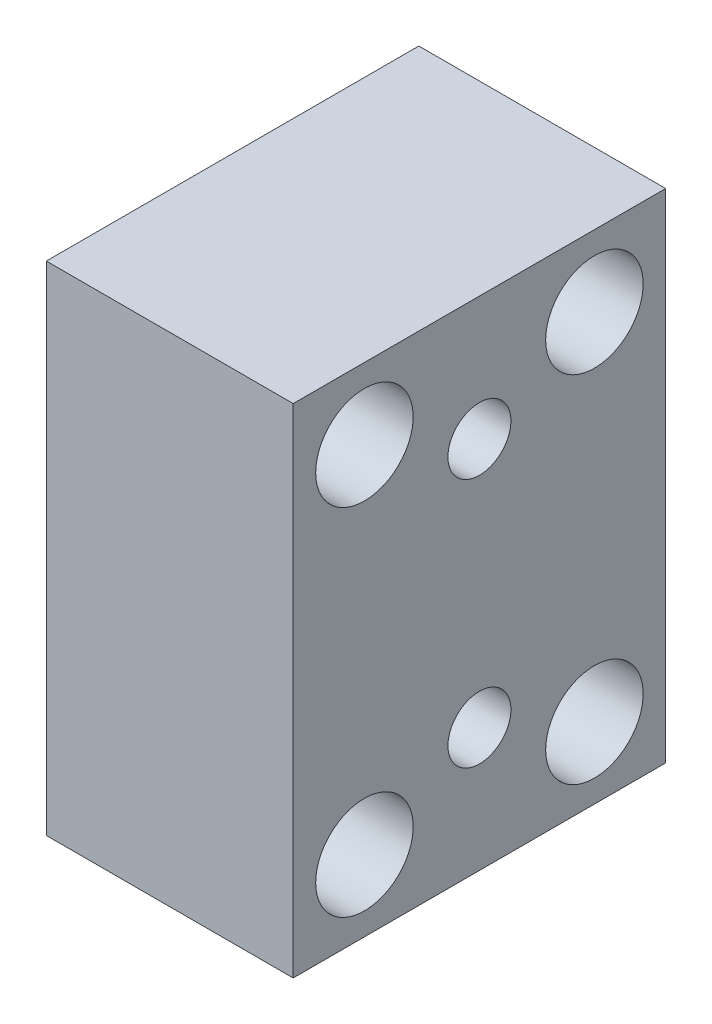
ISO-10303-21;
HEADER;
FILE_DESCRIPTION(('STEP AP214'),'2;1');
FILE_NAME('part.step','',(''),(''),'','','');
FILE_SCHEMA(('AUTOMOTIVE_DESIGN { 1 0 10303 214 1 1 1 1 }'));
ENDSEC;
DATA;
#1=APPLICATION_CONTEXT('core data for automotive mechanical design processes');
#2=APPLICATION_PROTOCOL_DEFINITION('international standard','automotive_design',2000,#1);
#3=PRODUCT_CONTEXT('',#1,'mechanical');
#4=PRODUCT('Part','Part','',(#3));
#5=PRODUCT_RELATED_PRODUCT_CATEGORY('part','',(#4));
#6=PRODUCT_DEFINITION_FORMATION('','',#4);
#7=PRODUCT_DEFINITION_CONTEXT('part definition',#1,'design');
#8=PRODUCT_DEFINITION('design','',#6,#7);
#9=PRODUCT_DEFINITION_SHAPE('','',#8);
#10=(LENGTH_UNIT() NAMED_UNIT(*) SI_UNIT(.MILLI.,.METRE.));
#11=(NAMED_UNIT(*) PLANE_ANGLE_UNIT() SI_UNIT($,.RADIAN.));
#12=(NAMED_UNIT(*) SI_UNIT($,.STERADIAN.) SOLID_ANGLE_UNIT());
#13=UNCERTAINTY_MEASURE_WITH_UNIT(LENGTH_MEASURE(1.E-05),#10,'distance_accuracy_value','');
#14=(GEOMETRIC_REPRESENTATION_CONTEXT(3) GLOBAL_UNCERTAINTY_ASSIGNED_CONTEXT((#13)) GLOBAL_UNIT_ASSIGNED_CONTEXT((#10,
#11,#12)) REPRESENTATION_CONTEXT('',''));
#15=CARTESIAN_POINT('',(0.,0.,0.));
#16=DIRECTION('',(0.,0.,1.));
#17=DIRECTION('',(1.,0.,0.));
#18=AXIS2_PLACEMENT_3D('',#15,#16,#17);
#19=CARTESIAN_POINT('',(12.54125,-25.273,18.923));
#20=DIRECTION('',(-1.,0.,0.));
#21=DIRECTION('',(0.,0.,1.));
#22=AXIS2_PLACEMENT_3D('',#19,#20,#21);
#23=PLANE('',#22);
#24=CARTESIAN_POINT('',(12.54125,-12.7,0.));
#25=DIRECTION('',(-1.,0.,0.));
#26=DIRECTION('',(0.,0.,1.));
#27=AXIS2_PLACEMENT_3D('',#24,#25,#26);
#28=CIRCLE('',#27,3.2004);
#29=CARTESIAN_POINT('',(12.54125,-12.7,3.2004));
#30=VERTEX_POINT('',#29);
#31=EDGE_CURVE('E224',#30,#30,#28,.F.);
#32=ORIENTED_EDGE('',*,*,#31,.F.);
#33=EDGE_LOOP('',(#32));
#34=FACE_BOUND('',#33,.T.);
#35=CARTESIAN_POINT('',(12.54125,-18.034,-11.684));
#36=DIRECTION('',(-1.,0.,0.));
#37=DIRECTION('',(0.,0.,1.));
#38=AXIS2_PLACEMENT_3D('',#35,#36,#37);
#39=CIRCLE('',#38,4.953);
#40=CARTESIAN_POINT('',(12.54125,-18.034,-6.731));
#41=VERTEX_POINT('',#40);
#42=EDGE_CURVE('E232',#41,#41,#39,.F.);
#43=ORIENTED_EDGE('',*,*,#42,.F.);
#44=EDGE_LOOP('',(#43));
#45=FACE_BOUND('',#44,.T.);
#46=CARTESIAN_POINT('',(12.54125,18.034,-11.684));
#47=DIRECTION('',(-1.,0.,0.));
#48=DIRECTION('',(0.,0.,1.));
#49=AXIS2_PLACEMENT_3D('',#46,#47,#48);
#50=CIRCLE('',#49,4.953);
#51=CARTESIAN_POINT('',(12.54125,18.034,-6.731));
#52=VERTEX_POINT('',#51);
#53=EDGE_CURVE('E338',#52,#52,#50,.F.);
#54=ORIENTED_EDGE('',*,*,#53,.F.);
#55=EDGE_LOOP('',(#54));
#56=FACE_BOUND('',#55,.T.);
#57=DIRECTION('',(0.,1.,0.));
#58=VECTOR('',#57,1.);
#59=CARTESIAN_POINT('',(12.54125,-25.273,-18.923));
#60=LINE('',#59,#58);
#61=CARTESIAN_POINT('',(12.54125,-25.273,-18.923));
#62=VERTEX_POINT('',#61);
#63=CARTESIAN_POINT('',(12.54125,25.273,-18.923));
#64=VERTEX_POINT('',#63);
#65=EDGE_CURVE('E359',#62,#64,#60,.T.);
#66=ORIENTED_EDGE('',*,*,#65,.T.);
#67=DIRECTION('',(0.,0.,-1.));
#68=VECTOR('',#67,1.);
#69=CARTESIAN_POINT('',(12.54125,25.273,18.923));
#70=LINE('',#69,#68);
#71=CARTESIAN_POINT('',(12.54125,25.273,18.923));
#72=VERTEX_POINT('',#71);
#73=EDGE_CURVE('E364',#72,#64,#70,.T.);
#74=ORIENTED_EDGE('',*,*,#73,.F.);
#75=DIRECTION('',(0.,1.,0.));
#76=VECTOR('',#75,1.);
#77=CARTESIAN_POINT('',(12.54125,-25.273,18.923));
#78=LINE('',#77,#76);
#79=CARTESIAN_POINT('',(12.54125,-25.273,18.923));
#80=VERTEX_POINT('',#79);
#81=EDGE_CURVE('E350',#80,#72,#78,.T.);
#82=ORIENTED_EDGE('',*,*,#81,.F.);
#83=DIRECTION('',(0.,0.,-1.));
#84=VECTOR('',#83,1.);
#85=CARTESIAN_POINT('',(12.54125,-25.273,18.923));
#86=LINE('',#85,#84);
#87=EDGE_CURVE('E367',#80,#62,#86,.T.);
#88=ORIENTED_EDGE('',*,*,#87,.T.);
#89=EDGE_LOOP('',(#66,#74,#82,#88));
#90=FACE_BOUND('',#89,.T.);
#91=CARTESIAN_POINT('',(12.54125,-18.034,11.684));
#92=DIRECTION('',(-1.,0.,0.));
#93=DIRECTION('',(0.,0.,1.));
#94=AXIS2_PLACEMENT_3D('',#91,#92,#93);
#95=CIRCLE('',#94,4.953);
#96=CARTESIAN_POINT('',(12.54125,-18.034,16.637));
#97=VERTEX_POINT('',#96);
#98=EDGE_CURVE('E339',#97,#97,#95,.F.);
#99=ORIENTED_EDGE('',*,*,#98,.F.);
#100=EDGE_LOOP('',(#99));
#101=FACE_BOUND('',#100,.T.);
#102=CARTESIAN_POINT('',(12.54125,18.034,11.684));
#103=DIRECTION('',(-1.,0.,0.));
#104=DIRECTION('',(0.,0.,1.));
#105=AXIS2_PLACEMENT_3D('',#102,#103,#104);
#106=CIRCLE('',#105,4.953);
#107=CARTESIAN_POINT('',(12.54125,18.034,16.637));
#108=VERTEX_POINT('',#107);
#109=EDGE_CURVE('E228',#108,#108,#106,.F.);
#110=ORIENTED_EDGE('',*,*,#109,.F.);
#111=EDGE_LOOP('',(#110));
#112=FACE_BOUND('',#111,.T.);
#113=CARTESIAN_POINT('',(12.54125,12.7,0.));
#114=DIRECTION('',(-1.,0.,0.));
#115=DIRECTION('',(0.,0.,1.));
#116=AXIS2_PLACEMENT_3D('',#113,#114,#115);
#117=CIRCLE('',#116,3.2004);
#118=CARTESIAN_POINT('',(12.54125,12.7,3.2004));
#119=VERTEX_POINT('',#118);
#120=EDGE_CURVE('E42',#119,#119,#117,.F.);
#121=ORIENTED_EDGE('',*,*,#120,.F.);
#122=EDGE_LOOP('',(#121));
#123=FACE_BOUND('',#122,.T.);
#124=ADVANCED_FACE('F38',(#34,#45,#56,#90,#101,#112,#123),#23,.F.);
#125=CARTESIAN_POINT('',(-12.573,18.034,11.684));
#126=DIRECTION('',(1.,0.,0.));
#127=DIRECTION('',(0.,0.,-1.));
#128=AXIS2_PLACEMENT_3D('',#125,#126,#127);
#129=PLANE('',#128);
#130=CARTESIAN_POINT('',(-12.573,18.034,11.684));
#131=DIRECTION('',(-1.,0.,0.));
#132=DIRECTION('',(0.,0.,1.));
#133=AXIS2_PLACEMENT_3D('',#130,#131,#132);
#134=CIRCLE('',#133,2.73558);
#135=CARTESIAN_POINT('',(-12.573,18.034,14.41958));
#136=VERTEX_POINT('',#135);
#137=EDGE_CURVE('E277',#136,#136,#134,.T.);
#138=ORIENTED_EDGE('',*,*,#137,.T.);
#139=EDGE_LOOP('',(#138));
#140=FACE_BOUND('',#139,.T.);
#141=DIRECTION('',(0.,-0.500000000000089,0.866025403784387));
#142=VECTOR('',#141,1.);
#143=CARTESIAN_POINT('',(-12.573,19.500469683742,11.684));
#144=LINE('',#143,#142);
#145=CARTESIAN_POINT('',(-12.573,19.500469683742,11.684));
#146=VERTEX_POINT('',#145);
#147=CARTESIAN_POINT('',(-12.573,18.767234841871,12.954));
#148=VERTEX_POINT('',#147);
#149=EDGE_CURVE('E55',#146,#148,#144,.T.);
#150=ORIENTED_EDGE('',*,*,#149,.T.);
#151=DIRECTION('',(0.,-1.,0.));
#152=VECTOR('',#151,1.);
#153=CARTESIAN_POINT('',(-12.573,18.767234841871,12.954));
#154=LINE('',#153,#152);
#155=CARTESIAN_POINT('',(-12.573,17.300765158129,12.954));
#156=VERTEX_POINT('',#155);
#157=EDGE_CURVE('E249',#148,#156,#154,.T.);
#158=ORIENTED_EDGE('',*,*,#157,.T.);
#159=DIRECTION('',(0.,-0.500000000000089,-0.866025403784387));
#160=VECTOR('',#159,1.);
#161=CARTESIAN_POINT('',(-12.573,17.300765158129,12.954));
#162=LINE('',#161,#160);
#163=CARTESIAN_POINT('',(-12.573,16.567530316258,11.684));
#164=VERTEX_POINT('',#163);
#165=EDGE_CURVE('E252',#156,#164,#162,.T.);
#166=ORIENTED_EDGE('',*,*,#165,.T.);
#167=DIRECTION('',(0.,0.500000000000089,-0.866025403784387));
#168=VECTOR('',#167,1.);
#169=CARTESIAN_POINT('',(-12.573,16.567530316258,11.684));
#170=LINE('',#169,#168);
#171=CARTESIAN_POINT('',(-12.573,17.300765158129,10.414));
#172=VERTEX_POINT('',#171);
#173=EDGE_CURVE('E255',#164,#172,#170,.T.);
#174=ORIENTED_EDGE('',*,*,#173,.T.);
#175=DIRECTION('',(0.,1.,0.));
#176=VECTOR('',#175,1.);
#177=CARTESIAN_POINT('',(-12.573,17.300765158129,10.414));
#178=LINE('',#177,#176);
#179=CARTESIAN_POINT('',(-12.573,18.767234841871,10.414));
#180=VERTEX_POINT('',#179);
#181=EDGE_CURVE('E258',#172,#180,#178,.T.);
#182=ORIENTED_EDGE('',*,*,#181,.T.);
#183=DIRECTION('',(0.,0.500000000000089,0.866025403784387));
#184=VECTOR('',#183,1.);
#185=CARTESIAN_POINT('',(-12.573,18.767234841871,10.414));
#186=LINE('',#185,#184);
#187=EDGE_CURVE('E237',#180,#146,#186,.T.);
#188=ORIENTED_EDGE('',*,*,#187,.T.);
#189=EDGE_LOOP('',(#150,#158,#166,#174,#182,#188));
#190=FACE_BOUND('',#189,.T.);
#191=ADVANCED_FACE('F393',(#140,#190),#129,.F.);
#192=CARTESIAN_POINT('',(0.,18.034,11.684));
#193=DIRECTION('',(1.,0.,0.));
#194=DIRECTION('',(0.,0.,-1.));
#195=AXIS2_PLACEMENT_3D('',#192,#193,#194);
#196=PLANE('',#195);
#197=CARTESIAN_POINT('',(0.,18.034,11.684));
#198=DIRECTION('',(1.,0.,0.));
#199=DIRECTION('',(0.,0.,-1.));
#200=AXIS2_PLACEMENT_3D('',#197,#198,#199);
#201=CIRCLE('',#200,4.5593);
#202=CARTESIAN_POINT('',(0.,18.034,7.1247));
#203=VERTEX_POINT('',#202);
#204=EDGE_CURVE('E331',#203,#203,#201,.T.);
#205=ORIENTED_EDGE('',*,*,#204,.F.);
#206=EDGE_LOOP('',(#205));
#207=FACE_BOUND('',#206,.T.);
#208=CARTESIAN_POINT('',(0.,18.034,11.684));
#209=DIRECTION('',(1.,0.,0.));
#210=DIRECTION('',(0.,0.,-1.));
#211=AXIS2_PLACEMENT_3D('',#208,#209,#210);
#212=CIRCLE('',#211,3.64744);
#213=CARTESIAN_POINT('',(0.,18.034,8.03656));
#214=VERTEX_POINT('',#213);
#215=EDGE_CURVE('E11',#214,#214,#212,.F.);
#216=ORIENTED_EDGE('',*,*,#215,.F.);
#217=EDGE_LOOP('',(#216));
#218=FACE_BOUND('',#217,.T.);
#219=ADVANCED_FACE('F484',(#207,#218),#196,.F.);
#220=CARTESIAN_POINT('',(-12.573,-18.034,-11.684));
#221=DIRECTION('',(1.,0.,0.));
#222=DIRECTION('',(0.,0.,-1.));
#223=AXIS2_PLACEMENT_3D('',#220,#221,#222);
#224=PLANE('',#223);
#225=CARTESIAN_POINT('',(-12.573,-18.034,-11.684));
#226=DIRECTION('',(-1.,0.,0.));
#227=DIRECTION('',(0.,0.,1.));
#228=AXIS2_PLACEMENT_3D('',#225,#226,#227);
#229=CIRCLE('',#228,2.73558);
#230=CARTESIAN_POINT('',(-12.573,-18.034,-8.94842));
#231=VERTEX_POINT('',#230);
#232=EDGE_CURVE('E324',#231,#231,#229,.T.);
#233=ORIENTED_EDGE('',*,*,#232,.T.);
#234=EDGE_LOOP('',(#233));
#235=FACE_BOUND('',#234,.T.);
#236=DIRECTION('',(0.,-0.500000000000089,0.866025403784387));
#237=VECTOR('',#236,1.);
#238=CARTESIAN_POINT('',(-12.573,-16.567530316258,-11.684));
#239=LINE('',#238,#237);
#240=CARTESIAN_POINT('',(-12.573,-16.567530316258,-11.684));
#241=VERTEX_POINT('',#240);
#242=CARTESIAN_POINT('',(-12.573,-17.300765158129,-10.414));
#243=VERTEX_POINT('',#242);
#244=EDGE_CURVE('E63',#241,#243,#239,.T.);
#245=ORIENTED_EDGE('',*,*,#244,.T.);
#246=DIRECTION('',(0.,-1.,0.));
#247=VECTOR('',#246,1.);
#248=CARTESIAN_POINT('',(-12.573,-17.300765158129,-10.414));
#249=LINE('',#248,#247);
#250=CARTESIAN_POINT('',(-12.573,-18.767234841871,-10.414));
#251=VERTEX_POINT('',#250);
#252=EDGE_CURVE('E296',#243,#251,#249,.T.);
#253=ORIENTED_EDGE('',*,*,#252,.T.);
#254=DIRECTION('',(0.,-0.500000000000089,-0.866025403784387));
#255=VECTOR('',#254,1.);
#256=CARTESIAN_POINT('',(-12.573,-18.767234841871,-10.414));
#257=LINE('',#256,#255);
#258=CARTESIAN_POINT('',(-12.573,-19.500469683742,-11.684));
#259=VERTEX_POINT('',#258);
#260=EDGE_CURVE('E299',#251,#259,#257,.T.);
#261=ORIENTED_EDGE('',*,*,#260,.T.);
#262=DIRECTION('',(0.,0.500000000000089,-0.866025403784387));
#263=VECTOR('',#262,1.);
#264=CARTESIAN_POINT('',(-12.573,-19.500469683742,-11.684));
#265=LINE('',#264,#263);
#266=CARTESIAN_POINT('',(-12.573,-18.767234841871,-12.954));
#267=VERTEX_POINT('',#266);
#268=EDGE_CURVE('E302',#259,#267,#265,.T.);
#269=ORIENTED_EDGE('',*,*,#268,.T.);
#270=DIRECTION('',(0.,1.,0.));
#271=VECTOR('',#270,1.);
#272=CARTESIAN_POINT('',(-12.573,-18.767234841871,-12.954));
#273=LINE('',#272,#271);
#274=CARTESIAN_POINT('',(-12.573,-17.300765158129,-12.954));
#275=VERTEX_POINT('',#274);
#276=EDGE_CURVE('E305',#267,#275,#273,.T.);
#277=ORIENTED_EDGE('',*,*,#276,.T.);
#278=DIRECTION('',(0.,0.500000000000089,0.866025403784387));
#279=VECTOR('',#278,1.);
#280=CARTESIAN_POINT('',(-12.573,-17.300765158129,-12.954));
#281=LINE('',#280,#279);
#282=EDGE_CURVE('E284',#275,#241,#281,.T.);
#283=ORIENTED_EDGE('',*,*,#282,.T.);
#284=EDGE_LOOP('',(#245,#253,#261,#269,#277,#283));
#285=FACE_BOUND('',#284,.T.);
#286=ADVANCED_FACE('F521',(#235,#285),#224,.F.);
#287=CARTESIAN_POINT('',(0.,-18.034,-11.684));
#288=DIRECTION('',(1.,0.,0.));
#289=DIRECTION('',(0.,0.,-1.));
#290=AXIS2_PLACEMENT_3D('',#287,#288,#289);
#291=PLANE('',#290);
#292=CARTESIAN_POINT('',(0.,-18.034,-11.684));
#293=DIRECTION('',(1.,0.,0.));
#294=DIRECTION('',(0.,0.,-1.));
#295=AXIS2_PLACEMENT_3D('',#292,#293,#294);
#296=CIRCLE('',#295,4.5593);
#297=CARTESIAN_POINT('',(0.,-18.034,-16.2433));
#298=VERTEX_POINT('',#297);
#299=EDGE_CURVE('E327',#298,#298,#296,.T.);
#300=ORIENTED_EDGE('',*,*,#299,.F.);
#301=EDGE_LOOP('',(#300));
#302=FACE_BOUND('',#301,.T.);
#303=CARTESIAN_POINT('',(0.,-18.034,-11.684));
#304=DIRECTION('',(1.,0.,0.));
#305=DIRECTION('',(0.,0.,-1.));
#306=AXIS2_PLACEMENT_3D('',#303,#304,#305);
#307=CIRCLE('',#306,3.64744);
#308=CARTESIAN_POINT('',(0.,-18.034,-15.33144));
#309=VERTEX_POINT('',#308);
#310=EDGE_CURVE('E47',#309,#309,#307,.F.);
#311=ORIENTED_EDGE('',*,*,#310,.F.);
#312=EDGE_LOOP('',(#311));
#313=FACE_BOUND('',#312,.T.);
#314=ADVANCED_FACE('F524',(#302,#313),#291,.F.);
#315=CARTESIAN_POINT('',(-12.54125,25.273,18.923));
#316=DIRECTION('',(1.,0.,0.));
#317=DIRECTION('',(0.,1.,0.));
#318=AXIS2_PLACEMENT_3D('',#315,#316,#317);
#319=PLANE('',#318);
#320=CARTESIAN_POINT('',(-12.54125,12.7,0.));
#321=DIRECTION('',(-1.,0.,0.));
#322=DIRECTION('',(0.,0.,1.));
#323=AXIS2_PLACEMENT_3D('',#320,#321,#322);
#324=CIRCLE('',#323,2.38125);
#325=CARTESIAN_POINT('',(-12.54125,12.7,2.38125));
#326=VERTEX_POINT('',#325);
#327=EDGE_CURVE('E184',#326,#326,#324,.T.);
#328=ORIENTED_EDGE('',*,*,#327,.F.);
#329=EDGE_LOOP('',(#328));
#330=FACE_BOUND('',#329,.T.);
#331=CARTESIAN_POINT('',(-12.54125,-12.7,0.));
#332=DIRECTION('',(-1.,0.,0.));
#333=DIRECTION('',(0.,0.,1.));
#334=AXIS2_PLACEMENT_3D('',#331,#332,#333);
#335=CIRCLE('',#334,2.38125);
#336=CARTESIAN_POINT('',(-12.54125,-12.7,2.38125));
#337=VERTEX_POINT('',#336);
#338=EDGE_CURVE('E183',#337,#337,#335,.T.);
#339=ORIENTED_EDGE('',*,*,#338,.F.);
#340=EDGE_LOOP('',(#339));
#341=FACE_BOUND('',#340,.T.);
#342=CARTESIAN_POINT('',(-12.54125,20.6375,0.));
#343=DIRECTION('',(-1.,0.,0.));
#344=DIRECTION('',(0.,0.,1.));
#345=AXIS2_PLACEMENT_3D('',#342,#343,#344);
#346=CIRCLE('',#345,2.01929999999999);
#347=CARTESIAN_POINT('',(-12.54125,20.6375,2.01929999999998));
#348=VERTEX_POINT('',#347);
#349=EDGE_CURVE('E194',#348,#348,#346,.T.);
#350=ORIENTED_EDGE('',*,*,#349,.F.);
#351=EDGE_LOOP('',(#350));
#352=FACE_BOUND('',#351,.T.);
#353=CARTESIAN_POINT('',(-12.54125,0.,-11.1125));
#354=DIRECTION('',(-1.,0.,0.));
#355=DIRECTION('',(0.,0.,1.));
#356=AXIS2_PLACEMENT_3D('',#353,#354,#355);
#357=CIRCLE('',#356,2.01929999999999);
#358=CARTESIAN_POINT('',(-12.54125,0.,-9.09320000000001));
#359=VERTEX_POINT('',#358);
#360=EDGE_CURVE('E200',#359,#359,#357,.T.);
#361=ORIENTED_EDGE('',*,*,#360,.F.);
#362=EDGE_LOOP('',(#361));
#363=FACE_BOUND('',#362,.T.);
#364=CARTESIAN_POINT('',(-12.54125,0.,11.1125));
#365=DIRECTION('',(-1.,0.,0.));
#366=DIRECTION('',(0.,0.,1.));
#367=AXIS2_PLACEMENT_3D('',#364,#365,#366);
#368=CIRCLE('',#367,2.01929999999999);
#369=CARTESIAN_POINT('',(-12.54125,0.,13.1318));
#370=VERTEX_POINT('',#369);
#371=EDGE_CURVE('E206',#370,#370,#368,.T.);
#372=ORIENTED_EDGE('',*,*,#371,.F.);
#373=EDGE_LOOP('',(#372));
#374=FACE_BOUND('',#373,.T.);
#375=CARTESIAN_POINT('',(-12.54125,-20.6375,0.));
#376=DIRECTION('',(-1.,0.,0.));
#377=DIRECTION('',(0.,0.,1.));
#378=AXIS2_PLACEMENT_3D('',#375,#376,#377);
#379=CIRCLE('',#378,2.01929999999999);
#380=CARTESIAN_POINT('',(-12.54125,-20.6375,2.01929999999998));
#381=VERTEX_POINT('',#380);
#382=EDGE_CURVE('E212',#381,#381,#379,.T.);
#383=ORIENTED_EDGE('',*,*,#382,.F.);
#384=EDGE_LOOP('',(#383));
#385=FACE_BOUND('',#384,.T.);
#386=CARTESIAN_POINT('',(-12.54125,18.034,11.684));
#387=DIRECTION('',(1.,0.,0.));
#388=DIRECTION('',(0.,1.,0.));
#389=AXIS2_PLACEMENT_3D('',#386,#387,#388);
#390=CIRCLE('',#389,4.5593);
#391=CARTESIAN_POINT('',(-12.54125,22.5933,11.684));
#392=VERTEX_POINT('',#391);
#393=EDGE_CURVE('E334',#392,#392,#390,.F.);
#394=ORIENTED_EDGE('',*,*,#393,.F.);
#395=EDGE_LOOP('',(#394));
#396=FACE_BOUND('',#395,.T.);
#397=CARTESIAN_POINT('',(-12.54125,18.034,-11.684));
#398=DIRECTION('',(1.,0.,0.));
#399=DIRECTION('',(0.,1.,0.));
#400=AXIS2_PLACEMENT_3D('',#397,#398,#399);
#401=CIRCLE('',#400,4.953);
#402=CARTESIAN_POINT('',(-12.54125,22.987,-11.684));
#403=VERTEX_POINT('',#402);
#404=EDGE_CURVE('E340',#403,#403,#401,.F.);
#405=ORIENTED_EDGE('',*,*,#404,.F.);
#406=EDGE_LOOP('',(#405));
#407=FACE_BOUND('',#406,.T.);
#408=DIRECTION('',(0.,-1.,0.));
#409=VECTOR('',#408,1.);
#410=CARTESIAN_POINT('',(-12.54125,25.273,-18.923));
#411=LINE('',#410,#409);
#412=CARTESIAN_POINT('',(-12.54125,25.273,-18.923));
#413=VERTEX_POINT('',#412);
#414=CARTESIAN_POINT('',(-12.54125,-25.273,-18.923));
#415=VERTEX_POINT('',#414);
#416=EDGE_CURVE('E343',#413,#415,#411,.T.);
#417=ORIENTED_EDGE('',*,*,#416,.T.);
#418=DIRECTION('',(0.,0.,-1.));
#419=VECTOR('',#418,1.);
#420=CARTESIAN_POINT('',(-12.54125,-25.273,18.923));
#421=LINE('',#420,#419);
#422=CARTESIAN_POINT('',(-12.54125,-25.273,18.923));
#423=VERTEX_POINT('',#422);
#424=EDGE_CURVE('E370',#423,#415,#421,.T.);
#425=ORIENTED_EDGE('',*,*,#424,.F.);
#426=DIRECTION('',(0.,-1.,0.));
#427=VECTOR('',#426,1.);
#428=CARTESIAN_POINT('',(-12.54125,25.273,18.923));
#429=LINE('',#428,#427);
#430=CARTESIAN_POINT('',(-12.54125,25.273,18.923));
#431=VERTEX_POINT('',#430);
#432=EDGE_CURVE('E344',#431,#423,#429,.T.);
#433=ORIENTED_EDGE('',*,*,#432,.F.);
#434=DIRECTION('',(0.,0.,-1.));
#435=VECTOR('',#434,1.);
#436=CARTESIAN_POINT('',(-12.54125,25.273,18.923));
#437=LINE('',#436,#435);
#438=EDGE_CURVE('E354',#431,#413,#437,.T.);
#439=ORIENTED_EDGE('',*,*,#438,.T.);
#440=EDGE_LOOP('',(#417,#425,#433,#439));
#441=FACE_BOUND('',#440,.T.);
#442=CARTESIAN_POINT('',(-12.54125,-18.034,11.684));
#443=DIRECTION('',(1.,0.,0.));
#444=DIRECTION('',(0.,1.,0.));
#445=AXIS2_PLACEMENT_3D('',#442,#443,#444);
#446=CIRCLE('',#445,4.953);
#447=CARTESIAN_POINT('',(-12.54125,-13.081,11.684));
#448=VERTEX_POINT('',#447);
#449=EDGE_CURVE('E335',#448,#448,#446,.F.);
#450=ORIENTED_EDGE('',*,*,#449,.F.);
#451=EDGE_LOOP('',(#450));
#452=FACE_BOUND('',#451,.T.);
#453=CARTESIAN_POINT('',(-12.54125,-18.034,-11.684));
#454=DIRECTION('',(1.,0.,0.));
#455=DIRECTION('',(0.,1.,0.));
#456=AXIS2_PLACEMENT_3D('',#453,#454,#455);
#457=CIRCLE('',#456,4.5593);
#458=CARTESIAN_POINT('',(-12.54125,-13.4747,-11.684));
#459=VERTEX_POINT('',#458);
#460=EDGE_CURVE('E330',#459,#459,#457,.F.);
#461=ORIENTED_EDGE('',*,*,#460,.F.);
#462=EDGE_LOOP('',(#461));
#463=FACE_BOUND('',#462,.T.);
#464=ADVANCED_FACE('F40',(#330,#341,#352,#363,#374,#385,#396,#407,#441,#452,#463),#319,.F.);
#465=CARTESIAN_POINT('',(-12.54125,-25.273,18.923));
#466=DIRECTION('',(0.,1.,0.));
#467=DIRECTION('',(0.,0.,1.));
#468=AXIS2_PLACEMENT_3D('',#465,#466,#467);
#469=PLANE('',#468);
#470=DIRECTION('',(1.,0.,0.));
#471=VECTOR('',#470,1.);
#472=CARTESIAN_POINT('',(-12.54125,-25.273,-18.923));
#473=LINE('',#472,#471);
#474=EDGE_CURVE('E357',#415,#62,#473,.T.);
#475=ORIENTED_EDGE('',*,*,#474,.T.);
#476=ORIENTED_EDGE('',*,*,#87,.F.);
#477=DIRECTION('',(1.,0.,0.));
#478=VECTOR('',#477,1.);
#479=CARTESIAN_POINT('',(-12.54125,-25.273,18.923));
#480=LINE('',#479,#478);
#481=EDGE_CURVE('E347',#423,#80,#480,.T.);
#482=ORIENTED_EDGE('',*,*,#481,.F.);
#483=ORIENTED_EDGE('',*,*,#424,.T.);
#484=EDGE_LOOP('',(#475,#476,#482,#483));
#485=FACE_BOUND('',#484,.T.);
#486=ADVANCED_FACE('F557',(#485),#469,.F.);
#487=CARTESIAN_POINT('',(12.54125,25.273,18.923));
#488=DIRECTION('',(0.,-1.,0.));
#489=DIRECTION('',(0.,0.,-1.));
#490=AXIS2_PLACEMENT_3D('',#487,#488,#489);
#491=PLANE('',#490);
#492=DIRECTION('',(-1.,0.,0.));
#493=VECTOR('',#492,1.);
#494=CARTESIAN_POINT('',(12.54125,25.273,-18.923));
#495=LINE('',#494,#493);
#496=EDGE_CURVE('E348',#64,#413,#495,.T.);
#497=ORIENTED_EDGE('',*,*,#496,.T.);
#498=ORIENTED_EDGE('',*,*,#438,.F.);
#499=DIRECTION('',(-1.,0.,0.));
#500=VECTOR('',#499,1.);
#501=CARTESIAN_POINT('',(12.54125,25.273,18.923));
#502=LINE('',#501,#500);
#503=EDGE_CURVE('E352',#72,#431,#502,.T.);
#504=ORIENTED_EDGE('',*,*,#503,.F.);
#505=ORIENTED_EDGE('',*,*,#73,.T.);
#506=EDGE_LOOP('',(#497,#498,#504,#505));
#507=FACE_BOUND('',#506,.T.);
#508=ADVANCED_FACE('F551',(#507),#491,.F.);
#509=CARTESIAN_POINT('',(-12.54125,-25.273,18.923));
#510=DIRECTION('',(0.,0.,1.));
#511=DIRECTION('',(1.,0.,0.));
#512=AXIS2_PLACEMENT_3D('',#509,#510,#511);
#513=PLANE('',#512);
#514=ORIENTED_EDGE('',*,*,#432,.T.);
#515=ORIENTED_EDGE('',*,*,#481,.T.);
#516=ORIENTED_EDGE('',*,*,#81,.T.);
#517=ORIENTED_EDGE('',*,*,#503,.T.);
#518=EDGE_LOOP('',(#514,#515,#516,#517));
#519=FACE_BOUND('',#518,.T.);
#520=ADVANCED_FACE('F548',(#519),#513,.T.);
#521=CARTESIAN_POINT('',(-12.54125,-25.273,-18.923));
#522=DIRECTION('',(0.,0.,1.));
#523=DIRECTION('',(1.,0.,0.));
#524=AXIS2_PLACEMENT_3D('',#521,#522,#523);
#525=PLANE('',#524);
#526=ORIENTED_EDGE('',*,*,#416,.F.);
#527=ORIENTED_EDGE('',*,*,#496,.F.);
#528=ORIENTED_EDGE('',*,*,#65,.F.);
#529=ORIENTED_EDGE('',*,*,#474,.F.);
#530=EDGE_LOOP('',(#526,#527,#528,#529));
#531=FACE_BOUND('',#530,.T.);
#532=ADVANCED_FACE('F546',(#531),#525,.F.);
#533=CARTESIAN_POINT('',(12.573,18.034,-11.684));
#534=DIRECTION('',(-1.,0.,0.));
#535=DIRECTION('',(0.,0.,1.));
#536=AXIS2_PLACEMENT_3D('',#533,#534,#535);
#537=CYLINDRICAL_SURFACE('',#536,4.953);
#538=ORIENTED_EDGE('',*,*,#53,.T.);
#539=EDGE_LOOP('',(#538));
#540=FACE_BOUND('',#539,.T.);
#541=ORIENTED_EDGE('',*,*,#404,.T.);
#542=EDGE_LOOP('',(#541));
#543=FACE_BOUND('',#542,.T.);
#544=ADVANCED_FACE('F542',(#540,#543),#537,.F.);
#545=CARTESIAN_POINT('',(12.573,-18.034,11.684));
#546=DIRECTION('',(-1.,0.,0.));
#547=DIRECTION('',(0.,0.,1.));
#548=AXIS2_PLACEMENT_3D('',#545,#546,#547);
#549=CYLINDRICAL_SURFACE('',#548,4.953);
#550=ORIENTED_EDGE('',*,*,#98,.T.);
#551=EDGE_LOOP('',(#550));
#552=FACE_BOUND('',#551,.T.);
#553=ORIENTED_EDGE('',*,*,#449,.T.);
#554=EDGE_LOOP('',(#553));
#555=FACE_BOUND('',#554,.T.);
#556=ADVANCED_FACE('F538',(#552,#555),#549,.F.);
#557=CARTESIAN_POINT('',(0.,18.034,11.684));
#558=DIRECTION('',(-1.,0.,0.));
#559=DIRECTION('',(0.,0.,1.));
#560=AXIS2_PLACEMENT_3D('',#557,#558,#559);
#561=CYLINDRICAL_SURFACE('',#560,4.5593);
#562=ORIENTED_EDGE('',*,*,#204,.T.);
#563=EDGE_LOOP('',(#562));
#564=FACE_BOUND('',#563,.T.);
#565=ORIENTED_EDGE('',*,*,#393,.T.);
#566=EDGE_LOOP('',(#565));
#567=FACE_BOUND('',#566,.T.);
#568=ADVANCED_FACE('F531',(#564,#567),#561,.F.);
#569=CARTESIAN_POINT('',(0.,-18.034,-11.684));
#570=DIRECTION('',(-1.,0.,0.));
#571=DIRECTION('',(0.,0.,1.));
#572=AXIS2_PLACEMENT_3D('',#569,#570,#571);
#573=CYLINDRICAL_SURFACE('',#572,4.5593);
#574=ORIENTED_EDGE('',*,*,#299,.T.);
#575=EDGE_LOOP('',(#574));
#576=FACE_BOUND('',#575,.T.);
#577=ORIENTED_EDGE('',*,*,#460,.T.);
#578=EDGE_LOOP('',(#577));
#579=FACE_BOUND('',#578,.T.);
#580=ADVANCED_FACE('F519',(#576,#579),#573,.F.);
#581=CARTESIAN_POINT('',(-11.6611400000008,-18.034,-11.684));
#582=DIRECTION('',(-1.,0.,0.));
#583=DIRECTION('',(0.,0.,1.));
#584=AXIS2_PLACEMENT_3D('',#581,#582,#583);
#585=TOROIDAL_SURFACE('',#584,2.7355800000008,0.911859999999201);
#586=ORIENTED_EDGE('',*,*,#232,.F.);
#587=EDGE_LOOP('',(#586));
#588=FACE_BOUND('',#587,.T.);
#589=CARTESIAN_POINT('',(-11.66114,-18.034,-11.684));
#590=DIRECTION('',(-1.,0.,0.));
#591=DIRECTION('',(0.,0.,1.));
#592=AXIS2_PLACEMENT_3D('',#589,#590,#591);
#593=CIRCLE('',#592,3.64744);
#594=CARTESIAN_POINT('',(-11.66114,-18.034,-8.03656));
#595=VERTEX_POINT('',#594);
#596=EDGE_CURVE('E321',#595,#595,#593,.T.);
#597=ORIENTED_EDGE('',*,*,#596,.T.);
#598=EDGE_LOOP('',(#597));
#599=FACE_BOUND('',#598,.T.);
#600=ADVANCED_FACE('F515',(#588,#599),#585,.T.);
#601=CARTESIAN_POINT('',(0.,-18.034,-11.684));
#602=DIRECTION('',(-1.,0.,0.));
#603=DIRECTION('',(0.,0.,1.));
#604=AXIS2_PLACEMENT_3D('',#601,#602,#603);
#605=CYLINDRICAL_SURFACE('',#604,3.64744);
#606=ORIENTED_EDGE('',*,*,#596,.F.);
#607=EDGE_LOOP('',(#606));
#608=FACE_BOUND('',#607,.T.);
#609=ORIENTED_EDGE('',*,*,#310,.T.);
#610=EDGE_LOOP('',(#609));
#611=FACE_BOUND('',#610,.T.);
#612=ADVANCED_FACE('F512',(#608,#611),#605,.T.);
#613=CARTESIAN_POINT('',(-6.2865,-16.567530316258,-11.684));
#614=DIRECTION('',(0.,-0.866025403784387,-0.500000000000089));
#615=DIRECTION('',(0.,0.500000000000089,-0.866025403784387));
#616=AXIS2_PLACEMENT_3D('',#613,#614,#615);
#617=PLANE('',#616);
#618=ORIENTED_EDGE('',*,*,#244,.F.);
#619=DIRECTION('',(-1.,0.,0.));
#620=VECTOR('',#619,1.);
#621=CARTESIAN_POINT('',(-6.2865,-16.567530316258,-11.684));
#622=LINE('',#621,#620);
#623=CARTESIAN_POINT('',(-6.2865,-16.567530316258,-11.684));
#624=VERTEX_POINT('',#623);
#625=EDGE_CURVE('E294',#624,#241,#622,.T.);
#626=ORIENTED_EDGE('',*,*,#625,.F.);
#627=DIRECTION('',(0.,-0.500000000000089,0.866025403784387));
#628=VECTOR('',#627,1.);
#629=CARTESIAN_POINT('',(-6.2865,-16.567530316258,-11.684));
#630=LINE('',#629,#628);
#631=CARTESIAN_POINT('',(-6.2865,-17.300765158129,-10.414));
#632=VERTEX_POINT('',#631);
#633=EDGE_CURVE('E280',#624,#632,#630,.T.);
#634=ORIENTED_EDGE('',*,*,#633,.T.);
#635=DIRECTION('',(-1.,0.,0.));
#636=VECTOR('',#635,1.);
#637=CARTESIAN_POINT('',(-6.2865,-17.300765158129,-10.414));
#638=LINE('',#637,#636);
#639=EDGE_CURVE('E319',#632,#243,#638,.T.);
#640=ORIENTED_EDGE('',*,*,#639,.T.);
#641=EDGE_LOOP('',(#618,#626,#634,#640));
#642=FACE_BOUND('',#641,.T.);
#643=ADVANCED_FACE('F508',(#642),#617,.T.);
#644=CARTESIAN_POINT('',(-6.2865,-17.300765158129,-10.414));
#645=DIRECTION('',(0.,0.,-1.));
#646=DIRECTION('',(-1.,0.,0.));
#647=AXIS2_PLACEMENT_3D('',#644,#645,#646);
#648=PLANE('',#647);
#649=ORIENTED_EDGE('',*,*,#252,.F.);
#650=ORIENTED_EDGE('',*,*,#639,.F.);
#651=DIRECTION('',(0.,-1.,0.));
#652=VECTOR('',#651,1.);
#653=CARTESIAN_POINT('',(-6.2865,-17.300765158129,-10.414));
#654=LINE('',#653,#652);
#655=CARTESIAN_POINT('',(-6.2865,-18.767234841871,-10.414));
#656=VERTEX_POINT('',#655);
#657=EDGE_CURVE('E283',#632,#656,#654,.T.);
#658=ORIENTED_EDGE('',*,*,#657,.T.);
#659=DIRECTION('',(-1.,0.,0.));
#660=VECTOR('',#659,1.);
#661=CARTESIAN_POINT('',(-6.2865,-18.767234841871,-10.414));
#662=LINE('',#661,#660);
#663=EDGE_CURVE('E317',#656,#251,#662,.T.);
#664=ORIENTED_EDGE('',*,*,#663,.T.);
#665=EDGE_LOOP('',(#649,#650,#658,#664));
#666=FACE_BOUND('',#665,.T.);
#667=ADVANCED_FACE('F504',(#666),#648,.T.);
#668=CARTESIAN_POINT('',(-6.2865,-18.767234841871,-10.414));
#669=DIRECTION('',(0.,0.866025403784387,-0.500000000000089));
#670=DIRECTION('',(0.,0.500000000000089,0.866025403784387));
#671=AXIS2_PLACEMENT_3D('',#668,#669,#670);
#672=PLANE('',#671);
#673=ORIENTED_EDGE('',*,*,#260,.F.);
#674=ORIENTED_EDGE('',*,*,#663,.F.);
#675=DIRECTION('',(0.,-0.500000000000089,-0.866025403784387));
#676=VECTOR('',#675,1.);
#677=CARTESIAN_POINT('',(-6.2865,-18.767234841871,-10.414));
#678=LINE('',#677,#676);
#679=CARTESIAN_POINT('',(-6.2865,-19.500469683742,-11.684));
#680=VERTEX_POINT('',#679);
#681=EDGE_CURVE('E286',#656,#680,#678,.T.);
#682=ORIENTED_EDGE('',*,*,#681,.T.);
#683=DIRECTION('',(-1.,0.,0.));
#684=VECTOR('',#683,1.);
#685=CARTESIAN_POINT('',(-6.2865,-19.500469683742,-11.684));
#686=LINE('',#685,#684);
#687=EDGE_CURVE('E315',#680,#259,#686,.T.);
#688=ORIENTED_EDGE('',*,*,#687,.T.);
#689=EDGE_LOOP('',(#673,#674,#682,#688));
#690=FACE_BOUND('',#689,.T.);
#691=ADVANCED_FACE('F500',(#690),#672,.T.);
#692=CARTESIAN_POINT('',(-6.2865,-19.500469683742,-11.684));
#693=DIRECTION('',(0.,0.866025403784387,0.500000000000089));
#694=DIRECTION('',(0.,-0.500000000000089,0.866025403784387));
#695=AXIS2_PLACEMENT_3D('',#692,#693,#694);
#696=PLANE('',#695);
#697=ORIENTED_EDGE('',*,*,#268,.F.);
#698=ORIENTED_EDGE('',*,*,#687,.F.);
#699=DIRECTION('',(0.,0.500000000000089,-0.866025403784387));
#700=VECTOR('',#699,1.);
#701=CARTESIAN_POINT('',(-6.2865,-19.500469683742,-11.684));
#702=LINE('',#701,#700);
#703=CARTESIAN_POINT('',(-6.2865,-18.767234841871,-12.954));
#704=VERTEX_POINT('',#703);
#705=EDGE_CURVE('E288',#680,#704,#702,.T.);
#706=ORIENTED_EDGE('',*,*,#705,.T.);
#707=DIRECTION('',(-1.,0.,0.));
#708=VECTOR('',#707,1.);
#709=CARTESIAN_POINT('',(-6.2865,-18.767234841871,-12.954));
#710=LINE('',#709,#708);
#711=EDGE_CURVE('E313',#704,#267,#710,.T.);
#712=ORIENTED_EDGE('',*,*,#711,.T.);
#713=EDGE_LOOP('',(#697,#698,#706,#712));
#714=FACE_BOUND('',#713,.T.);
#715=ADVANCED_FACE('F496',(#714),#696,.T.);
#716=CARTESIAN_POINT('',(-6.2865,-18.767234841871,-12.954));
#717=DIRECTION('',(0.,0.,1.));
#718=DIRECTION('',(1.,0.,0.));
#719=AXIS2_PLACEMENT_3D('',#716,#717,#718);
#720=PLANE('',#719);
#721=ORIENTED_EDGE('',*,*,#276,.F.);
#722=ORIENTED_EDGE('',*,*,#711,.F.);
#723=DIRECTION('',(0.,1.,0.));
#724=VECTOR('',#723,1.);
#725=CARTESIAN_POINT('',(-6.2865,-18.767234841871,-12.954));
#726=LINE('',#725,#724);
#727=CARTESIAN_POINT('',(-6.2865,-17.300765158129,-12.954));
#728=VERTEX_POINT('',#727);
#729=EDGE_CURVE('E290',#704,#728,#726,.T.);
#730=ORIENTED_EDGE('',*,*,#729,.T.);
#731=DIRECTION('',(-1.,0.,0.));
#732=VECTOR('',#731,1.);
#733=CARTESIAN_POINT('',(-6.2865,-17.300765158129,-12.954));
#734=LINE('',#733,#732);
#735=EDGE_CURVE('E311',#728,#275,#734,.T.);
#736=ORIENTED_EDGE('',*,*,#735,.T.);
#737=EDGE_LOOP('',(#721,#722,#730,#736));
#738=FACE_BOUND('',#737,.T.);
#739=ADVANCED_FACE('F492',(#738),#720,.T.);
#740=CARTESIAN_POINT('',(-6.2865,-17.300765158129,-12.954));
#741=DIRECTION('',(0.,-0.866025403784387,0.500000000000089));
#742=DIRECTION('',(0.,-0.500000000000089,-0.866025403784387));
#743=AXIS2_PLACEMENT_3D('',#740,#741,#742);
#744=PLANE('',#743);
#745=ORIENTED_EDGE('',*,*,#282,.F.);
#746=ORIENTED_EDGE('',*,*,#735,.F.);
#747=DIRECTION('',(0.,0.500000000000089,0.866025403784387));
#748=VECTOR('',#747,1.);
#749=CARTESIAN_POINT('',(-6.2865,-17.300765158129,-12.954));
#750=LINE('',#749,#748);
#751=EDGE_CURVE('E292',#728,#624,#750,.T.);
#752=ORIENTED_EDGE('',*,*,#751,.T.);
#753=ORIENTED_EDGE('',*,*,#625,.T.);
#754=EDGE_LOOP('',(#745,#746,#752,#753));
#755=FACE_BOUND('',#754,.T.);
#756=ADVANCED_FACE('F488',(#755),#744,.T.);
#757=CARTESIAN_POINT('',(-6.2865,-18.034,-9.144));
#758=DIRECTION('',(1.,0.,0.));
#759=DIRECTION('',(0.,0.,-1.));
#760=AXIS2_PLACEMENT_3D('',#757,#758,#759);
#761=PLANE('',#760);
#762=ORIENTED_EDGE('',*,*,#633,.F.);
#763=ORIENTED_EDGE('',*,*,#751,.F.);
#764=ORIENTED_EDGE('',*,*,#729,.F.);
#765=ORIENTED_EDGE('',*,*,#705,.F.);
#766=ORIENTED_EDGE('',*,*,#681,.F.);
#767=ORIENTED_EDGE('',*,*,#657,.F.);
#768=EDGE_LOOP('',(#762,#763,#764,#765,#766,#767));
#769=FACE_BOUND('',#768,.T.);
#770=ADVANCED_FACE('F480',(#769),#761,.F.);
#771=CARTESIAN_POINT('',(-11.6611400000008,18.034,11.684));
#772=DIRECTION('',(-1.,0.,0.));
#773=DIRECTION('',(0.,0.,1.));
#774=AXIS2_PLACEMENT_3D('',#771,#772,#773);
#775=TOROIDAL_SURFACE('',#774,2.73558000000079,0.911859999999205);
#776=ORIENTED_EDGE('',*,*,#137,.F.);
#777=EDGE_LOOP('',(#776));
#778=FACE_BOUND('',#777,.T.);
#779=CARTESIAN_POINT('',(-11.66114,18.034,11.684));
#780=DIRECTION('',(-1.,0.,0.));
#781=DIRECTION('',(0.,0.,1.));
#782=AXIS2_PLACEMENT_3D('',#779,#780,#781);
#783=CIRCLE('',#782,3.64744);
#784=CARTESIAN_POINT('',(-11.66114,18.034,15.33144));
#785=VERTEX_POINT('',#784);
#786=EDGE_CURVE('E274',#785,#785,#783,.T.);
#787=ORIENTED_EDGE('',*,*,#786,.T.);
#788=EDGE_LOOP('',(#787));
#789=FACE_BOUND('',#788,.T.);
#790=ADVANCED_FACE('F476',(#778,#789),#775,.T.);
#791=CARTESIAN_POINT('',(0.,18.034,11.684));
#792=DIRECTION('',(-1.,0.,0.));
#793=DIRECTION('',(0.,0.,1.));
#794=AXIS2_PLACEMENT_3D('',#791,#792,#793);
#795=CYLINDRICAL_SURFACE('',#794,3.64744);
#796=ORIENTED_EDGE('',*,*,#786,.F.);
#797=EDGE_LOOP('',(#796));
#798=FACE_BOUND('',#797,.T.);
#799=ORIENTED_EDGE('',*,*,#215,.T.);
#800=EDGE_LOOP('',(#799));
#801=FACE_BOUND('',#800,.T.);
#802=ADVANCED_FACE('F473',(#798,#801),#795,.T.);
#803=CARTESIAN_POINT('',(-6.2865,19.500469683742,11.684));
#804=DIRECTION('',(0.,-0.866025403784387,-0.500000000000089));
#805=DIRECTION('',(0.,0.500000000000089,-0.866025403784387));
#806=AXIS2_PLACEMENT_3D('',#803,#804,#805);
#807=PLANE('',#806);
#808=ORIENTED_EDGE('',*,*,#149,.F.);
#809=DIRECTION('',(-1.,0.,0.));
#810=VECTOR('',#809,1.);
#811=CARTESIAN_POINT('',(-6.2865,19.500469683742,11.684));
#812=LINE('',#811,#810);
#813=CARTESIAN_POINT('',(-6.2865,19.500469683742,11.684));
#814=VERTEX_POINT('',#813);
#815=EDGE_CURVE('E247',#814,#146,#812,.T.);
#816=ORIENTED_EDGE('',*,*,#815,.F.);
#817=DIRECTION('',(0.,-0.500000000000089,0.866025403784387));
#818=VECTOR('',#817,1.);
#819=CARTESIAN_POINT('',(-6.2865,19.500469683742,11.684));
#820=LINE('',#819,#818);
#821=CARTESIAN_POINT('',(-6.2865,18.767234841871,12.954));
#822=VERTEX_POINT('',#821);
#823=EDGE_CURVE('E233',#814,#822,#820,.T.);
#824=ORIENTED_EDGE('',*,*,#823,.T.);
#825=DIRECTION('',(-1.,0.,0.));
#826=VECTOR('',#825,1.);
#827=CARTESIAN_POINT('',(-6.2865,18.767234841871,12.954));
#828=LINE('',#827,#826);
#829=EDGE_CURVE('E272',#822,#148,#828,.T.);
#830=ORIENTED_EDGE('',*,*,#829,.T.);
#831=EDGE_LOOP('',(#808,#816,#824,#830));
#832=FACE_BOUND('',#831,.T.);
#833=ADVANCED_FACE('F469',(#832),#807,.T.);
#834=CARTESIAN_POINT('',(-6.2865,18.767234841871,12.954));
#835=DIRECTION('',(0.,0.,-1.));
#836=DIRECTION('',(-1.,0.,0.));
#837=AXIS2_PLACEMENT_3D('',#834,#835,#836);
#838=PLANE('',#837);
#839=ORIENTED_EDGE('',*,*,#157,.F.);
#840=ORIENTED_EDGE('',*,*,#829,.F.);
#841=DIRECTION('',(0.,-1.,0.));
#842=VECTOR('',#841,1.);
#843=CARTESIAN_POINT('',(-6.2865,18.767234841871,12.954));
#844=LINE('',#843,#842);
#845=CARTESIAN_POINT('',(-6.2865,17.300765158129,12.954));
#846=VERTEX_POINT('',#845);
#847=EDGE_CURVE('E236',#822,#846,#844,.T.);
#848=ORIENTED_EDGE('',*,*,#847,.T.);
#849=DIRECTION('',(-1.,0.,0.));
#850=VECTOR('',#849,1.);
#851=CARTESIAN_POINT('',(-6.2865,17.300765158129,12.954));
#852=LINE('',#851,#850);
#853=EDGE_CURVE('E270',#846,#156,#852,.T.);
#854=ORIENTED_EDGE('',*,*,#853,.T.);
#855=EDGE_LOOP('',(#839,#840,#848,#854));
#856=FACE_BOUND('',#855,.T.);
#857=ADVANCED_FACE('F465',(#856),#838,.T.);
#858=CARTESIAN_POINT('',(-6.2865,17.300765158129,12.954));
#859=DIRECTION('',(0.,0.866025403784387,-0.500000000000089));
#860=DIRECTION('',(0.,0.500000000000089,0.866025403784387));
#861=AXIS2_PLACEMENT_3D('',#858,#859,#860);
#862=PLANE('',#861);
#863=ORIENTED_EDGE('',*,*,#165,.F.);
#864=ORIENTED_EDGE('',*,*,#853,.F.);
#865=DIRECTION('',(0.,-0.500000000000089,-0.866025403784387));
#866=VECTOR('',#865,1.);
#867=CARTESIAN_POINT('',(-6.2865,17.300765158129,12.954));
#868=LINE('',#867,#866);
#869=CARTESIAN_POINT('',(-6.2865,16.567530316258,11.684));
#870=VERTEX_POINT('',#869);
#871=EDGE_CURVE('E239',#846,#870,#868,.T.);
#872=ORIENTED_EDGE('',*,*,#871,.T.);
#873=DIRECTION('',(-1.,0.,0.));
#874=VECTOR('',#873,1.);
#875=CARTESIAN_POINT('',(-6.2865,16.567530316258,11.684));
#876=LINE('',#875,#874);
#877=EDGE_CURVE('E268',#870,#164,#876,.T.);
#878=ORIENTED_EDGE('',*,*,#877,.T.);
#879=EDGE_LOOP('',(#863,#864,#872,#878));
#880=FACE_BOUND('',#879,.T.);
#881=ADVANCED_FACE('F461',(#880),#862,.T.);
#882=CARTESIAN_POINT('',(-6.2865,16.567530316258,11.684));
#883=DIRECTION('',(0.,0.866025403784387,0.500000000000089));
#884=DIRECTION('',(0.,-0.500000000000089,0.866025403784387));
#885=AXIS2_PLACEMENT_3D('',#882,#883,#884);
#886=PLANE('',#885);
#887=ORIENTED_EDGE('',*,*,#173,.F.);
#888=ORIENTED_EDGE('',*,*,#877,.F.);
#889=DIRECTION('',(0.,0.500000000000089,-0.866025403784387));
#890=VECTOR('',#889,1.);
#891=CARTESIAN_POINT('',(-6.2865,16.567530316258,11.684));
#892=LINE('',#891,#890);
#893=CARTESIAN_POINT('',(-6.2865,17.300765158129,10.414));
#894=VERTEX_POINT('',#893);
#895=EDGE_CURVE('E241',#870,#894,#892,.T.);
#896=ORIENTED_EDGE('',*,*,#895,.T.);
#897=DIRECTION('',(-1.,0.,0.));
#898=VECTOR('',#897,1.);
#899=CARTESIAN_POINT('',(-6.2865,17.300765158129,10.414));
#900=LINE('',#899,#898);
#901=EDGE_CURVE('E266',#894,#172,#900,.T.);
#902=ORIENTED_EDGE('',*,*,#901,.T.);
#903=EDGE_LOOP('',(#887,#888,#896,#902));
#904=FACE_BOUND('',#903,.T.);
#905=ADVANCED_FACE('F457',(#904),#886,.T.);
#906=CARTESIAN_POINT('',(-6.2865,17.300765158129,10.414));
#907=DIRECTION('',(0.,0.,1.));
#908=DIRECTION('',(1.,0.,0.));
#909=AXIS2_PLACEMENT_3D('',#906,#907,#908);
#910=PLANE('',#909);
#911=ORIENTED_EDGE('',*,*,#181,.F.);
#912=ORIENTED_EDGE('',*,*,#901,.F.);
#913=DIRECTION('',(0.,1.,0.));
#914=VECTOR('',#913,1.);
#915=CARTESIAN_POINT('',(-6.2865,17.300765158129,10.414));
#916=LINE('',#915,#914);
#917=CARTESIAN_POINT('',(-6.2865,18.767234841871,10.414));
#918=VERTEX_POINT('',#917);
#919=EDGE_CURVE('E243',#894,#918,#916,.T.);
#920=ORIENTED_EDGE('',*,*,#919,.T.);
#921=DIRECTION('',(-1.,0.,0.));
#922=VECTOR('',#921,1.);
#923=CARTESIAN_POINT('',(-6.2865,18.767234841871,10.414));
#924=LINE('',#923,#922);
#925=EDGE_CURVE('E264',#918,#180,#924,.T.);
#926=ORIENTED_EDGE('',*,*,#925,.T.);
#927=EDGE_LOOP('',(#911,#912,#920,#926));
#928=FACE_BOUND('',#927,.T.);
#929=ADVANCED_FACE('F453',(#928),#910,.T.);
#930=CARTESIAN_POINT('',(-6.2865,18.767234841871,10.414));
#931=DIRECTION('',(0.,-0.866025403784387,0.500000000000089));
#932=DIRECTION('',(0.,-0.500000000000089,-0.866025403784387));
#933=AXIS2_PLACEMENT_3D('',#930,#931,#932);
#934=PLANE('',#933);
#935=ORIENTED_EDGE('',*,*,#187,.F.);
#936=ORIENTED_EDGE('',*,*,#925,.F.);
#937=DIRECTION('',(0.,0.500000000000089,0.866025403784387));
#938=VECTOR('',#937,1.);
#939=CARTESIAN_POINT('',(-6.2865,18.767234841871,10.414));
#940=LINE('',#939,#938);
#941=EDGE_CURVE('E245',#918,#814,#940,.T.);
#942=ORIENTED_EDGE('',*,*,#941,.T.);
#943=ORIENTED_EDGE('',*,*,#815,.T.);
#944=EDGE_LOOP('',(#935,#936,#942,#943));
#945=FACE_BOUND('',#944,.T.);
#946=ADVANCED_FACE('F449',(#945),#934,.T.);
#947=CARTESIAN_POINT('',(-6.2865,18.034,14.224));
#948=DIRECTION('',(1.,0.,0.));
#949=DIRECTION('',(0.,0.,-1.));
#950=AXIS2_PLACEMENT_3D('',#947,#948,#949);
#951=PLANE('',#950);
#952=ORIENTED_EDGE('',*,*,#823,.F.);
#953=ORIENTED_EDGE('',*,*,#941,.F.);
#954=ORIENTED_EDGE('',*,*,#919,.F.);
#955=ORIENTED_EDGE('',*,*,#895,.F.);
#956=ORIENTED_EDGE('',*,*,#871,.F.);
#957=ORIENTED_EDGE('',*,*,#847,.F.);
#958=EDGE_LOOP('',(#952,#953,#954,#955,#956,#957));
#959=FACE_BOUND('',#958,.T.);
#960=ADVANCED_FACE('F442',(#959),#951,.F.);
#961=CARTESIAN_POINT('',(20.955,-18.034,-11.684));
#962=DIRECTION('',(-1.,0.,0.));
#963=DIRECTION('',(0.,0.,1.));
#964=AXIS2_PLACEMENT_3D('',#961,#962,#963);
#965=CYLINDRICAL_SURFACE('',#964,4.953);
#966=CARTESIAN_POINT('',(4.191,-18.034,-11.684));
#967=DIRECTION('',(-1.,0.,0.));
#968=DIRECTION('',(0.,0.,1.));
#969=AXIS2_PLACEMENT_3D('',#966,#967,#968);
#970=CIRCLE('',#969,4.953);
#971=CARTESIAN_POINT('',(4.191,-18.034,-6.731));
#972=VERTEX_POINT('',#971);
#973=EDGE_CURVE('E229',#972,#972,#970,.T.);
#974=ORIENTED_EDGE('',*,*,#973,.T.);
#975=EDGE_LOOP('',(#974));
#976=FACE_BOUND('',#975,.T.);
#977=ORIENTED_EDGE('',*,*,#42,.T.);
#978=EDGE_LOOP('',(#977));
#979=FACE_BOUND('',#978,.T.);
#980=ADVANCED_FACE('F439',(#976,#979),#965,.F.);
#981=CARTESIAN_POINT('',(4.191,-18.034,-11.684));
#982=DIRECTION('',(1.,0.,0.));
#983=DIRECTION('',(0.,0.,-1.));
#984=AXIS2_PLACEMENT_3D('',#981,#982,#983);
#985=PLANE('',#984);
#986=ORIENTED_EDGE('',*,*,#973,.F.);
#987=EDGE_LOOP('',(#986));
#988=FACE_BOUND('',#987,.T.);
#989=ADVANCED_FACE('F434',(#988),#985,.T.);
#990=CARTESIAN_POINT('',(20.955,18.034,11.684));
#991=DIRECTION('',(-1.,0.,0.));
#992=DIRECTION('',(0.,0.,1.));
#993=AXIS2_PLACEMENT_3D('',#990,#991,#992);
#994=CYLINDRICAL_SURFACE('',#993,4.953);
#995=CARTESIAN_POINT('',(4.191,18.034,11.684));
#996=DIRECTION('',(-1.,0.,0.));
#997=DIRECTION('',(0.,0.,1.));
#998=AXIS2_PLACEMENT_3D('',#995,#996,#997);
#999=CIRCLE('',#998,4.953);
#1000=CARTESIAN_POINT('',(4.191,18.034,16.637));
#1001=VERTEX_POINT('',#1000);
#1002=EDGE_CURVE('E225',#1001,#1001,#999,.T.);
#1003=ORIENTED_EDGE('',*,*,#1002,.T.);
#1004=EDGE_LOOP('',(#1003));
#1005=FACE_BOUND('',#1004,.T.);
#1006=ORIENTED_EDGE('',*,*,#109,.T.);
#1007=EDGE_LOOP('',(#1006));
#1008=FACE_BOUND('',#1007,.T.);
#1009=ADVANCED_FACE('F431',(#1005,#1008),#994,.F.);
#1010=CARTESIAN_POINT('',(4.191,18.034,11.684));
#1011=DIRECTION('',(1.,0.,0.));
#1012=DIRECTION('',(0.,0.,-1.));
#1013=AXIS2_PLACEMENT_3D('',#1010,#1011,#1012);
#1014=PLANE('',#1013);
#1015=ORIENTED_EDGE('',*,*,#1002,.F.);
#1016=EDGE_LOOP('',(#1015));
#1017=FACE_BOUND('',#1016,.T.);
#1018=ADVANCED_FACE('F428',(#1017),#1014,.T.);
#1019=CARTESIAN_POINT('',(20.955,-12.7,0.));
#1020=DIRECTION('',(-1.,0.,0.));
#1021=DIRECTION('',(0.,0.,1.));
#1022=AXIS2_PLACEMENT_3D('',#1019,#1020,#1021);
#1023=CYLINDRICAL_SURFACE('',#1022,3.2004);
#1024=CARTESIAN_POINT('',(4.191,-12.7,0.));
#1025=DIRECTION('',(-1.,0.,0.));
#1026=DIRECTION('',(0.,0.,1.));
#1027=AXIS2_PLACEMENT_3D('',#1024,#1025,#1026);
#1028=CIRCLE('',#1027,3.2004);
#1029=CARTESIAN_POINT('',(4.191,-12.7,3.2004));
#1030=VERTEX_POINT('',#1029);
#1031=EDGE_CURVE('E221',#1030,#1030,#1028,.T.);
#1032=ORIENTED_EDGE('',*,*,#1031,.T.);
#1033=EDGE_LOOP('',(#1032));
#1034=FACE_BOUND('',#1033,.T.);
#1035=ORIENTED_EDGE('',*,*,#31,.T.);
#1036=EDGE_LOOP('',(#1035));
#1037=FACE_BOUND('',#1036,.T.);
#1038=ADVANCED_FACE('F389',(#1034,#1037),#1023,.F.);
#1039=CARTESIAN_POINT('',(4.191,-12.7,0.));
#1040=DIRECTION('',(1.,0.,0.));
#1041=DIRECTION('',(0.,0.,-1.));
#1042=AXIS2_PLACEMENT_3D('',#1039,#1040,#1041);
#1043=PLANE('',#1042);
#1044=ORIENTED_EDGE('',*,*,#1031,.F.);
#1045=EDGE_LOOP('',(#1044));
#1046=FACE_BOUND('',#1045,.T.);
#1047=ADVANCED_FACE('F412',(#1046),#1043,.T.);
#1048=CARTESIAN_POINT('',(20.955,12.7,0.));
#1049=DIRECTION('',(-1.,0.,0.));
#1050=DIRECTION('',(0.,0.,1.));
#1051=AXIS2_PLACEMENT_3D('',#1048,#1049,#1050);
#1052=CYLINDRICAL_SURFACE('',#1051,3.2004);
#1053=CARTESIAN_POINT('',(4.191,12.7,0.));
#1054=DIRECTION('',(-1.,0.,0.));
#1055=DIRECTION('',(0.,0.,1.));
#1056=AXIS2_PLACEMENT_3D('',#1053,#1054,#1055);
#1057=CIRCLE('',#1056,3.2004);
#1058=CARTESIAN_POINT('',(4.191,12.7,3.2004));
#1059=VERTEX_POINT('',#1058);
#1060=EDGE_CURVE('E218',#1059,#1059,#1057,.T.);
#1061=ORIENTED_EDGE('',*,*,#1060,.T.);
#1062=EDGE_LOOP('',(#1061));
#1063=FACE_BOUND('',#1062,.T.);
#1064=ORIENTED_EDGE('',*,*,#120,.T.);
#1065=EDGE_LOOP('',(#1064));
#1066=FACE_BOUND('',#1065,.T.);
#1067=ADVANCED_FACE('F409',(#1063,#1066),#1052,.F.);
#1068=CARTESIAN_POINT('',(4.191,12.7,0.));
#1069=DIRECTION('',(1.,0.,0.));
#1070=DIRECTION('',(0.,0.,-1.));
#1071=AXIS2_PLACEMENT_3D('',#1068,#1069,#1070);
#1072=PLANE('',#1071);
#1073=ORIENTED_EDGE('',*,*,#1060,.F.);
#1074=EDGE_LOOP('',(#1073));
#1075=FACE_BOUND('',#1074,.T.);
#1076=ADVANCED_FACE('F411',(#1075),#1072,.T.);
#1077=CARTESIAN_POINT('',(2.54634999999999,-20.6375,0.));
#1078=DIRECTION('',(-1.,0.,0.));
#1079=DIRECTION('',(0.,0.,1.));
#1080=AXIS2_PLACEMENT_3D('',#1077,#1078,#1079);
#1081=CONICAL_SURFACE('',#1080,2.0193,1.0471975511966);
#1082=CARTESIAN_POINT('',(3.71219339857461,-20.6375,0.));
#1083=VERTEX_POINT('',#1082);
#1084=VERTEX_LOOP('',#1083);
#1085=FACE_BOUND('',#1084,.T.);
#1086=CARTESIAN_POINT('',(2.54634999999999,-20.6375,0.));
#1087=DIRECTION('',(-1.,0.,0.));
#1088=DIRECTION('',(0.,0.,1.));
#1089=AXIS2_PLACEMENT_3D('',#1086,#1087,#1088);
#1090=CIRCLE('',#1089,2.0193);
#1091=CARTESIAN_POINT('',(2.54634999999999,-20.6375,2.01929999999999));
#1092=VERTEX_POINT('',#1091);
#1093=EDGE_CURVE('E215',#1092,#1092,#1090,.T.);
#1094=ORIENTED_EDGE('',*,*,#1093,.T.);
#1095=EDGE_LOOP('',(#1094));
#1096=FACE_BOUND('',#1095,.T.);
#1097=ADVANCED_FACE('F419',(#1085,#1096),#1081,.F.);
#1098=CARTESIAN_POINT('',(-12.54125,-20.6375,0.));
#1099=DIRECTION('',(-1.,0.,0.));
#1100=DIRECTION('',(0.,0.,1.));
#1101=AXIS2_PLACEMENT_3D('',#1098,#1099,#1100);
#1102=CYLINDRICAL_SURFACE('',#1101,2.01929999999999);
#1103=ORIENTED_EDGE('',*,*,#1093,.F.);
#1104=EDGE_LOOP('',(#1103));
#1105=FACE_BOUND('',#1104,.T.);
#1106=ORIENTED_EDGE('',*,*,#382,.T.);
#1107=EDGE_LOOP('',(#1106));
#1108=FACE_BOUND('',#1107,.T.);
#1109=ADVANCED_FACE('F600',(#1105,#1108),#1102,.F.);
#1110=CARTESIAN_POINT('',(2.54634999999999,0.,11.1125));
#1111=DIRECTION('',(-1.,0.,0.));
#1112=DIRECTION('',(0.,0.,1.));
#1113=AXIS2_PLACEMENT_3D('',#1110,#1111,#1112);
#1114=CONICAL_SURFACE('',#1113,2.0193,1.0471975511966);
#1115=CARTESIAN_POINT('',(3.71219339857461,0.,11.1125));
#1116=VERTEX_POINT('',#1115);
#1117=VERTEX_LOOP('',#1116);
#1118=FACE_BOUND('',#1117,.T.);
#1119=CARTESIAN_POINT('',(2.54634999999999,0.,11.1125));
#1120=DIRECTION('',(-1.,0.,0.));
#1121=DIRECTION('',(0.,0.,1.));
#1122=AXIS2_PLACEMENT_3D('',#1119,#1120,#1121);
#1123=CIRCLE('',#1122,2.0193);
#1124=CARTESIAN_POINT('',(2.54634999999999,0.,13.1318));
#1125=VERTEX_POINT('',#1124);
#1126=EDGE_CURVE('E209',#1125,#1125,#1123,.T.);
#1127=ORIENTED_EDGE('',*,*,#1126,.T.);
#1128=EDGE_LOOP('',(#1127));
#1129=FACE_BOUND('',#1128,.T.);
#1130=ADVANCED_FACE('F602',(#1118,#1129),#1114,.F.);
#1131=CARTESIAN_POINT('',(-12.54125,0.,11.1125));
#1132=DIRECTION('',(-1.,0.,0.));
#1133=DIRECTION('',(0.,0.,1.));
#1134=AXIS2_PLACEMENT_3D('',#1131,#1132,#1133);
#1135=CYLINDRICAL_SURFACE('',#1134,2.01929999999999);
#1136=ORIENTED_EDGE('',*,*,#1126,.F.);
#1137=EDGE_LOOP('',(#1136));
#1138=FACE_BOUND('',#1137,.T.);
#1139=ORIENTED_EDGE('',*,*,#371,.T.);
#1140=EDGE_LOOP('',(#1139));
#1141=FACE_BOUND('',#1140,.T.);
#1142=ADVANCED_FACE('F608',(#1138,#1141),#1135,.F.);
#1143=CARTESIAN_POINT('',(2.54634999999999,0.,-11.1125));
#1144=DIRECTION('',(-1.,0.,0.));
#1145=DIRECTION('',(0.,0.,1.));
#1146=AXIS2_PLACEMENT_3D('',#1143,#1144,#1145);
#1147=CONICAL_SURFACE('',#1146,2.0193,1.0471975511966);
#1148=CARTESIAN_POINT('',(3.71219339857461,0.,-11.1125));
#1149=VERTEX_POINT('',#1148);
#1150=VERTEX_LOOP('',#1149);
#1151=FACE_BOUND('',#1150,.T.);
#1152=CARTESIAN_POINT('',(2.54634999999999,0.,-11.1125));
#1153=DIRECTION('',(-1.,0.,0.));
#1154=DIRECTION('',(0.,0.,1.));
#1155=AXIS2_PLACEMENT_3D('',#1152,#1153,#1154);
#1156=CIRCLE('',#1155,2.0193);
#1157=CARTESIAN_POINT('',(2.54634999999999,0.,-9.0932));
#1158=VERTEX_POINT('',#1157);
#1159=EDGE_CURVE('E203',#1158,#1158,#1156,.T.);
#1160=ORIENTED_EDGE('',*,*,#1159,.T.);
#1161=EDGE_LOOP('',(#1160));
#1162=FACE_BOUND('',#1161,.T.);
#1163=ADVANCED_FACE('F616',(#1151,#1162),#1147,.F.);
#1164=CARTESIAN_POINT('',(-12.54125,0.,-11.1125));
#1165=DIRECTION('',(-1.,0.,0.));
#1166=DIRECTION('',(0.,0.,1.));
#1167=AXIS2_PLACEMENT_3D('',#1164,#1165,#1166);
#1168=CYLINDRICAL_SURFACE('',#1167,2.01929999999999);
#1169=ORIENTED_EDGE('',*,*,#1159,.F.);
#1170=EDGE_LOOP('',(#1169));
#1171=FACE_BOUND('',#1170,.T.);
#1172=ORIENTED_EDGE('',*,*,#360,.T.);
#1173=EDGE_LOOP('',(#1172));
#1174=FACE_BOUND('',#1173,.T.);
#1175=ADVANCED_FACE('F620',(#1171,#1174),#1168,.F.);
#1176=CARTESIAN_POINT('',(2.54634999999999,20.6375,0.));
#1177=DIRECTION('',(-1.,0.,0.));
#1178=DIRECTION('',(0.,0.,1.));
#1179=AXIS2_PLACEMENT_3D('',#1176,#1177,#1178);
#1180=CONICAL_SURFACE('',#1179,2.0193,1.0471975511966);
#1181=CARTESIAN_POINT('',(3.71219339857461,20.6375,0.));
#1182=VERTEX_POINT('',#1181);
#1183=VERTEX_LOOP('',#1182);
#1184=FACE_BOUND('',#1183,.T.);
#1185=CARTESIAN_POINT('',(2.54634999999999,20.6375,0.));
#1186=DIRECTION('',(-1.,0.,0.));
#1187=DIRECTION('',(0.,0.,1.));
#1188=AXIS2_PLACEMENT_3D('',#1185,#1186,#1187);
#1189=CIRCLE('',#1188,2.0193);
#1190=CARTESIAN_POINT('',(2.54634999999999,20.6375,2.01929999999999));
#1191=VERTEX_POINT('',#1190);
#1192=EDGE_CURVE('E197',#1191,#1191,#1189,.T.);
#1193=ORIENTED_EDGE('',*,*,#1192,.T.);
#1194=EDGE_LOOP('',(#1193));
#1195=FACE_BOUND('',#1194,.T.);
#1196=ADVANCED_FACE('F624',(#1184,#1195),#1180,.F.);
#1197=CARTESIAN_POINT('',(-12.54125,20.6375,0.));
#1198=DIRECTION('',(-1.,0.,0.));
#1199=DIRECTION('',(0.,0.,1.));
#1200=AXIS2_PLACEMENT_3D('',#1197,#1198,#1199);
#1201=CYLINDRICAL_SURFACE('',#1200,2.01929999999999);
#1202=ORIENTED_EDGE('',*,*,#1192,.F.);
#1203=EDGE_LOOP('',(#1202));
#1204=FACE_BOUND('',#1203,.T.);
#1205=ORIENTED_EDGE('',*,*,#349,.T.);
#1206=EDGE_LOOP('',(#1205));
#1207=FACE_BOUND('',#1206,.T.);
#1208=ADVANCED_FACE('F628',(#1204,#1207),#1201,.F.);
#1209=CARTESIAN_POINT('',(0.158749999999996,-12.7,0.));
#1210=DIRECTION('',(-1.,0.,0.));
#1211=DIRECTION('',(0.,0.,1.));
#1212=AXIS2_PLACEMENT_3D('',#1209,#1210,#1211);
#1213=CONICAL_SURFACE('',#1212,2.38125,1.02974425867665);
#1214=CARTESIAN_POINT('',(1.58954934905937,-12.7,0.));
#1215=VERTEX_POINT('',#1214);
#1216=VERTEX_LOOP('',#1215);
#1217=FACE_BOUND('',#1216,.T.);
#1218=CARTESIAN_POINT('',(0.158749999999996,-12.7,0.));
#1219=DIRECTION('',(-1.,0.,0.));
#1220=DIRECTION('',(0.,0.,1.));
#1221=AXIS2_PLACEMENT_3D('',#1218,#1219,#1220);
#1222=CIRCLE('',#1221,2.38125);
#1223=CARTESIAN_POINT('',(0.158749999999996,-12.7,2.38124999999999));
#1224=VERTEX_POINT('',#1223);
#1225=EDGE_CURVE('E187',#1224,#1224,#1222,.T.);
#1226=ORIENTED_EDGE('',*,*,#1225,.T.);
#1227=EDGE_LOOP('',(#1226));
#1228=FACE_BOUND('',#1227,.T.);
#1229=ADVANCED_FACE('F632',(#1217,#1228),#1213,.F.);
#1230=CARTESIAN_POINT('',(-12.54125,-12.7,0.));
#1231=DIRECTION('',(-1.,0.,0.));
#1232=DIRECTION('',(0.,0.,1.));
#1233=AXIS2_PLACEMENT_3D('',#1230,#1231,#1232);
#1234=CYLINDRICAL_SURFACE('',#1233,2.38125);
#1235=ORIENTED_EDGE('',*,*,#1225,.F.);
#1236=EDGE_LOOP('',(#1235));
#1237=FACE_BOUND('',#1236,.T.);
#1238=ORIENTED_EDGE('',*,*,#338,.T.);
#1239=EDGE_LOOP('',(#1238));
#1240=FACE_BOUND('',#1239,.T.);
#1241=ADVANCED_FACE('F177',(#1237,#1240),#1234,.F.);
#1242=CARTESIAN_POINT('',(0.158749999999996,12.7,0.));
#1243=DIRECTION('',(-1.,0.,0.));
#1244=DIRECTION('',(0.,0.,1.));
#1245=AXIS2_PLACEMENT_3D('',#1242,#1243,#1244);
#1246=CONICAL_SURFACE('',#1245,2.38125,1.02974425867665);
#1247=CARTESIAN_POINT('',(1.58954934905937,12.7,0.));
#1248=VERTEX_POINT('',#1247);
#1249=VERTEX_LOOP('',#1248);
#1250=FACE_BOUND('',#1249,.T.);
#1251=CARTESIAN_POINT('',(0.158749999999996,12.7,0.));
#1252=DIRECTION('',(-1.,0.,0.));
#1253=DIRECTION('',(0.,0.,1.));
#1254=AXIS2_PLACEMENT_3D('',#1251,#1252,#1253);
#1255=CIRCLE('',#1254,2.38125);
#1256=CARTESIAN_POINT('',(0.158749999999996,12.7,2.38124999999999));
#1257=VERTEX_POINT('',#1256);
#1258=EDGE_CURVE('E181',#1257,#1257,#1255,.T.);
#1259=ORIENTED_EDGE('',*,*,#1258,.T.);
#1260=EDGE_LOOP('',(#1259));
#1261=FACE_BOUND('',#1260,.T.);
#1262=ADVANCED_FACE('F173',(#1250,#1261),#1246,.F.);
#1263=CARTESIAN_POINT('',(-12.54125,12.7,0.));
#1264=DIRECTION('',(-1.,0.,0.));
#1265=DIRECTION('',(0.,0.,1.));
#1266=AXIS2_PLACEMENT_3D('',#1263,#1264,#1265);
#1267=CYLINDRICAL_SURFACE('',#1266,2.38125);
#1268=ORIENTED_EDGE('',*,*,#1258,.F.);
#1269=EDGE_LOOP('',(#1268));
#1270=FACE_BOUND('',#1269,.T.);
#1271=ORIENTED_EDGE('',*,*,#327,.T.);
#1272=EDGE_LOOP('',(#1271));
#1273=FACE_BOUND('',#1272,.T.);
#1274=ADVANCED_FACE('F176',(#1270,#1273),#1267,.F.);
#1275=CLOSED_SHELL('',(#124,#191,#219,#286,#314,#464,#486,#508,#520,#532,#544,#556,#568,#580,
#600,#612,#643,#667,#691,#715,#739,#756,#770,#790,#802,#833,#857,#881,#905,#929,#946,#960,#980,
#989,#1009,#1018,#1038,#1047,#1067,#1076,#1097,#1109,#1130,#1142,#1163,#1175,#1196,#1208,#1229,
#1241,#1262,#1274));
#1276=MANIFOLD_SOLID_BREP('B2',#1275);
#1277=ADVANCED_BREP_SHAPE_REPRESENTATION('',(#18,#1276),#14);
#1278=SHAPE_DEFINITION_REPRESENTATION(#9,#1277);
ENDSEC;
END-ISO-10303-21;
